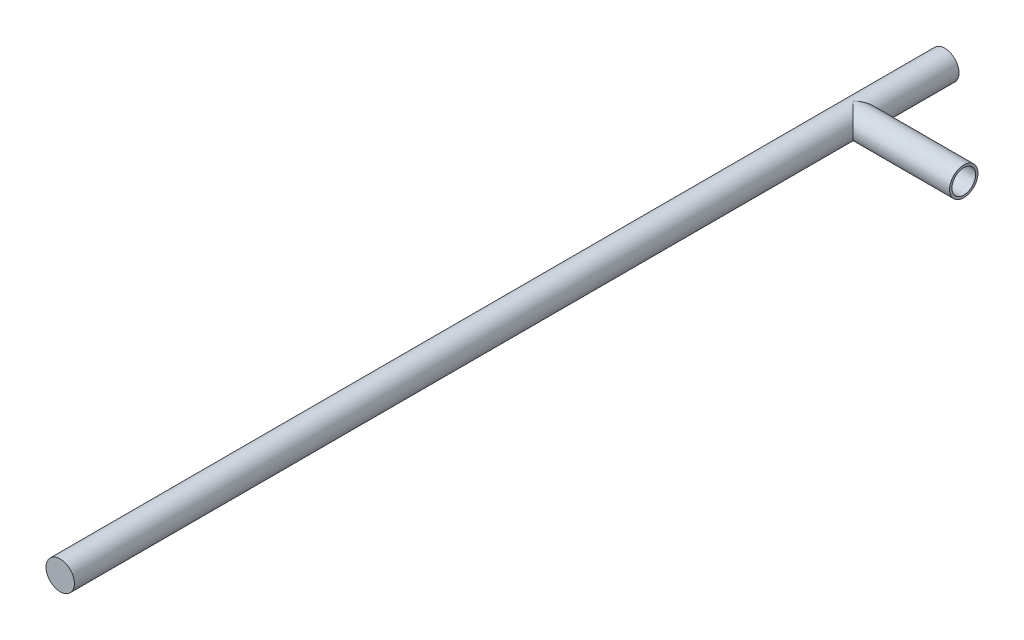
from build123d import *

# Parameters (mm, degrees)
CROQUIS1_R                 = 9
SALIENTE_EXTRUIR1_DEPTH    = 560
CORTAR_EXTRUIR1_REACH      = 562.145
CORTAR_EXTRUIR1_END_RADIUS = 9
CROQUIS3_R                 = 4.7625
CROQUIS4_R                 = 9
SALIENTE_EXTRUIR3_DEPTH    = 70
CROQUIS5_R                 = 7.5
CORTAR_EXTRUIR2_DEPTH      = 557
CROQUIS6_R                 = 7.5
CORTAR_EXTRUIR3_DEPTH      = 70


with BuildPart() as part:
    # Croquis1 → Saliente-Extruir1 (new body)
    with BuildSketch(Plane.XY):
        Circle(CROQUIS1_R)
    extrude(amount=SALIENTE_EXTRUIR1_DEPTH)

    # Cortar-Extruir1: up to this cylinder (the profile starts inside it)
    cortar_extruir1_end = Plane(origin=(0, 0, 286.576), z_dir=(0, 0, -1)) * Cylinder(CORTAR_EXTRUIR1_END_RADIUS, 1676.69, mode=Mode.PRIVATE)
    # Croquis3 → Cortar-Extruir1 (cut, up to the surface)
    with BuildSketch(Plane(origin=(0, 0, 0), x_dir=(0, 0, -1), z_dir=(1, 0, 0)), mode=Mode.PRIVATE) as cortar_extruir1_sk1:
        with Locations((-19.876, 0)):
            Circle(CROQUIS3_R)
    cortar_extruir1_tool1 = extrude(cortar_extruir1_sk1.sketch, amount=-CORTAR_EXTRUIR1_REACH, mode=Mode.PRIVATE) & cortar_extruir1_end
    add(cortar_extruir1_tool1.solids().sort_by_distance((0, 0, 19.876))[0], mode=Mode.SUBTRACT)
    # Croquis3 → Cortar-Extruir1 (cut, up to the surface)
    with BuildSketch(Plane(origin=(0, 0, 0), x_dir=(0, 0, -1), z_dir=(1, 0, 0)), mode=Mode.PRIVATE) as cortar_extruir1_sk2:
        with Locations((-45.276, 0)):
            Circle(CROQUIS3_R)
    cortar_extruir1_tool2 = extrude(cortar_extruir1_sk2.sketch, amount=-CORTAR_EXTRUIR1_REACH, mode=Mode.PRIVATE) & cortar_extruir1_end
    add(cortar_extruir1_tool2.solids().sort_by_distance((0, 0, 45.276))[0], mode=Mode.SUBTRACT)
    # Croquis3 → Cortar-Extruir1 (cut, up to the surface)
    with BuildSketch(Plane(origin=(0, 0, 0), x_dir=(0, 0, -1), z_dir=(1, 0, 0)), mode=Mode.PRIVATE) as cortar_extruir1_sk3:
        with Locations((-70.676, 0)):
            Circle(CROQUIS3_R)
    cortar_extruir1_tool3 = extrude(cortar_extruir1_sk3.sketch, amount=-CORTAR_EXTRUIR1_REACH, mode=Mode.PRIVATE) & cortar_extruir1_end
    add(cortar_extruir1_tool3.solids().sort_by_distance((0, 0, 70.676))[0], mode=Mode.SUBTRACT)
    # Croquis3 → Cortar-Extruir1 (cut, up to the surface)
    with BuildSketch(Plane(origin=(0, 0, 0), x_dir=(0, 0, -1), z_dir=(1, 0, 0)), mode=Mode.PRIVATE) as cortar_extruir1_sk4:
        with Locations((-96.076, 0)):
            Circle(CROQUIS3_R)
    cortar_extruir1_tool4 = extrude(cortar_extruir1_sk4.sketch, amount=-CORTAR_EXTRUIR1_REACH, mode=Mode.PRIVATE) & cortar_extruir1_end
    add(cortar_extruir1_tool4.solids().sort_by_distance((0, 0, 96.076))[0], mode=Mode.SUBTRACT)
    # Croquis3 → Cortar-Extruir1 (cut, up to the surface)
    with BuildSketch(Plane(origin=(0, 0, 0), x_dir=(0, 0, -1), z_dir=(1, 0, 0)), mode=Mode.PRIVATE) as cortar_extruir1_sk5:
        with Locations((-121.476, 0)):
            Circle(CROQUIS3_R)
    cortar_extruir1_tool5 = extrude(cortar_extruir1_sk5.sketch, amount=-CORTAR_EXTRUIR1_REACH, mode=Mode.PRIVATE) & cortar_extruir1_end
    add(cortar_extruir1_tool5.solids().sort_by_distance((0, 0, 121.476))[0], mode=Mode.SUBTRACT)
    # Croquis3 → Cortar-Extruir1 (cut, up to the surface)
    with BuildSketch(Plane(origin=(0, 0, 0), x_dir=(0, 0, -1), z_dir=(1, 0, 0)), mode=Mode.PRIVATE) as cortar_extruir1_sk6:
        with Locations((-146.876, 0)):
            Circle(CROQUIS3_R)
    cortar_extruir1_tool6 = extrude(cortar_extruir1_sk6.sketch, amount=-CORTAR_EXTRUIR1_REACH, mode=Mode.PRIVATE) & cortar_extruir1_end
    add(cortar_extruir1_tool6.solids().sort_by_distance((0, 0, 146.876))[0], mode=Mode.SUBTRACT)
    # Croquis3 → Cortar-Extruir1 (cut, up to the surface)
    with BuildSketch(Plane(origin=(0, 0, 0), x_dir=(0, 0, -1), z_dir=(1, 0, 0)), mode=Mode.PRIVATE) as cortar_extruir1_sk7:
        with Locations((-172.276, 0)):
            Circle(CROQUIS3_R)
    cortar_extruir1_tool7 = extrude(cortar_extruir1_sk7.sketch, amount=-CORTAR_EXTRUIR1_REACH, mode=Mode.PRIVATE) & cortar_extruir1_end
    add(cortar_extruir1_tool7.solids().sort_by_distance((0, 0, 172.276))[0], mode=Mode.SUBTRACT)
    # Croquis3 → Cortar-Extruir1 (cut, up to the surface)
    with BuildSketch(Plane(origin=(0, 0, 0), x_dir=(0, 0, -1), z_dir=(1, 0, 0)), mode=Mode.PRIVATE) as cortar_extruir1_sk8:
        with Locations((-197.676, 0)):
            Circle(CROQUIS3_R)
    cortar_extruir1_tool8 = extrude(cortar_extruir1_sk8.sketch, amount=-CORTAR_EXTRUIR1_REACH, mode=Mode.PRIVATE) & cortar_extruir1_end
    add(cortar_extruir1_tool8.solids().sort_by_distance((0, 0, 197.676))[0], mode=Mode.SUBTRACT)
    # Croquis3 → Cortar-Extruir1 (cut, up to the surface)
    with BuildSketch(Plane(origin=(0, 0, 0), x_dir=(0, 0, -1), z_dir=(1, 0, 0)), mode=Mode.PRIVATE) as cortar_extruir1_sk9:
        with Locations((-223.076, 0)):
            Circle(CROQUIS3_R)
    cortar_extruir1_tool9 = extrude(cortar_extruir1_sk9.sketch, amount=-CORTAR_EXTRUIR1_REACH, mode=Mode.PRIVATE) & cortar_extruir1_end
    add(cortar_extruir1_tool9.solids().sort_by_distance((0, 0, 223.076))[0], mode=Mode.SUBTRACT)
    # Croquis3 → Cortar-Extruir1 (cut, up to the surface)
    with BuildSketch(Plane(origin=(0, 0, 0), x_dir=(0, 0, -1), z_dir=(1, 0, 0)), mode=Mode.PRIVATE) as cortar_extruir1_sk10:
        with Locations((-248.476, 0)):
            Circle(CROQUIS3_R)
    cortar_extruir1_tool10 = extrude(cortar_extruir1_sk10.sketch, amount=-CORTAR_EXTRUIR1_REACH, mode=Mode.PRIVATE) & cortar_extruir1_end
    add(cortar_extruir1_tool10.solids().sort_by_distance((0, 0, 248.476))[0], mode=Mode.SUBTRACT)
    # Croquis3 → Cortar-Extruir1 (cut, up to the surface)
    with BuildSketch(Plane(origin=(0, 0, 0), x_dir=(0, 0, -1), z_dir=(1, 0, 0)), mode=Mode.PRIVATE) as cortar_extruir1_sk11:
        with Locations((-273.876, 0)):
            Circle(CROQUIS3_R)
    cortar_extruir1_tool11 = extrude(cortar_extruir1_sk11.sketch, amount=-CORTAR_EXTRUIR1_REACH, mode=Mode.PRIVATE) & cortar_extruir1_end
    add(cortar_extruir1_tool11.solids().sort_by_distance((0, 0, 273.876))[0], mode=Mode.SUBTRACT)
    # Croquis3 → Cortar-Extruir1 (cut, up to the surface)
    with BuildSketch(Plane(origin=(0, 0, 0), x_dir=(0, 0, -1), z_dir=(1, 0, 0)), mode=Mode.PRIVATE) as cortar_extruir1_sk12:
        with Locations((-299.276, 0)):
            Circle(CROQUIS3_R)
    cortar_extruir1_tool12 = extrude(cortar_extruir1_sk12.sketch, amount=-CORTAR_EXTRUIR1_REACH, mode=Mode.PRIVATE) & cortar_extruir1_end
    add(cortar_extruir1_tool12.solids().sort_by_distance((0, 0, 299.276))[0], mode=Mode.SUBTRACT)
    # Croquis3 → Cortar-Extruir1 (cut, up to the surface)
    with BuildSketch(Plane(origin=(0, 0, 0), x_dir=(0, 0, -1), z_dir=(1, 0, 0)), mode=Mode.PRIVATE) as cortar_extruir1_sk13:
        with Locations((-324.676, 0)):
            Circle(CROQUIS3_R)
    cortar_extruir1_tool13 = extrude(cortar_extruir1_sk13.sketch, amount=-CORTAR_EXTRUIR1_REACH, mode=Mode.PRIVATE) & cortar_extruir1_end
    add(cortar_extruir1_tool13.solids().sort_by_distance((0, 0, 324.676))[0], mode=Mode.SUBTRACT)
    # Croquis3 → Cortar-Extruir1 (cut, up to the surface)
    with BuildSketch(Plane(origin=(0, 0, 0), x_dir=(0, 0, -1), z_dir=(1, 0, 0)), mode=Mode.PRIVATE) as cortar_extruir1_sk14:
        with Locations((-350.076, 0)):
            Circle(CROQUIS3_R)
    cortar_extruir1_tool14 = extrude(cortar_extruir1_sk14.sketch, amount=-CORTAR_EXTRUIR1_REACH, mode=Mode.PRIVATE) & cortar_extruir1_end
    add(cortar_extruir1_tool14.solids().sort_by_distance((0, 0, 350.076))[0], mode=Mode.SUBTRACT)
    # Croquis3 → Cortar-Extruir1 (cut, up to the surface)
    with BuildSketch(Plane(origin=(0, 0, 0), x_dir=(0, 0, -1), z_dir=(1, 0, 0)), mode=Mode.PRIVATE) as cortar_extruir1_sk15:
        with Locations((-375.476, 0)):
            Circle(CROQUIS3_R)
    cortar_extruir1_tool15 = extrude(cortar_extruir1_sk15.sketch, amount=-CORTAR_EXTRUIR1_REACH, mode=Mode.PRIVATE) & cortar_extruir1_end
    add(cortar_extruir1_tool15.solids().sort_by_distance((0, 0, 375.476))[0], mode=Mode.SUBTRACT)
    # Croquis3 → Cortar-Extruir1 (cut, up to the surface)
    with BuildSketch(Plane(origin=(0, 0, 0), x_dir=(0, 0, -1), z_dir=(1, 0, 0)), mode=Mode.PRIVATE) as cortar_extruir1_sk16:
        with Locations((-400.876, 0)):
            Circle(CROQUIS3_R)
    cortar_extruir1_tool16 = extrude(cortar_extruir1_sk16.sketch, amount=-CORTAR_EXTRUIR1_REACH, mode=Mode.PRIVATE) & cortar_extruir1_end
    add(cortar_extruir1_tool16.solids().sort_by_distance((0, 0, 400.876))[0], mode=Mode.SUBTRACT)
    # Croquis3 → Cortar-Extruir1 (cut, up to the surface)
    with BuildSketch(Plane(origin=(0, 0, 0), x_dir=(0, 0, -1), z_dir=(1, 0, 0)), mode=Mode.PRIVATE) as cortar_extruir1_sk17:
        with Locations((-426.276, 0)):
            Circle(CROQUIS3_R)
    cortar_extruir1_tool17 = extrude(cortar_extruir1_sk17.sketch, amount=-CORTAR_EXTRUIR1_REACH, mode=Mode.PRIVATE) & cortar_extruir1_end
    add(cortar_extruir1_tool17.solids().sort_by_distance((0, 0, 426.276))[0], mode=Mode.SUBTRACT)
    # Croquis3 → Cortar-Extruir1 (cut, up to the surface)
    with BuildSketch(Plane(origin=(0, 0, 0), x_dir=(0, 0, -1), z_dir=(1, 0, 0)), mode=Mode.PRIVATE) as cortar_extruir1_sk18:
        with Locations((-451.676, 0)):
            Circle(CROQUIS3_R)
    cortar_extruir1_tool18 = extrude(cortar_extruir1_sk18.sketch, amount=-CORTAR_EXTRUIR1_REACH, mode=Mode.PRIVATE) & cortar_extruir1_end
    add(cortar_extruir1_tool18.solids().sort_by_distance((0, 0, 451.676))[0], mode=Mode.SUBTRACT)
    # Croquis3 → Cortar-Extruir1 (cut, up to the surface)
    with BuildSketch(Plane(origin=(0, 0, 0), x_dir=(0, 0, -1), z_dir=(1, 0, 0)), mode=Mode.PRIVATE) as cortar_extruir1_sk19:
        with Locations((-477.076, 0)):
            Circle(CROQUIS3_R)
    cortar_extruir1_tool19 = extrude(cortar_extruir1_sk19.sketch, amount=-CORTAR_EXTRUIR1_REACH, mode=Mode.PRIVATE) & cortar_extruir1_end
    add(cortar_extruir1_tool19.solids().sort_by_distance((0, 0, 477.076))[0], mode=Mode.SUBTRACT)
    # Croquis3 → Cortar-Extruir1 (cut, up to the surface)
    with BuildSketch(Plane(origin=(0, 0, 0), x_dir=(0, 0, -1), z_dir=(1, 0, 0)), mode=Mode.PRIVATE) as cortar_extruir1_sk20:
        with Locations((-502.476, 0)):
            Circle(CROQUIS3_R)
    cortar_extruir1_tool20 = extrude(cortar_extruir1_sk20.sketch, amount=-CORTAR_EXTRUIR1_REACH, mode=Mode.PRIVATE) & cortar_extruir1_end
    add(cortar_extruir1_tool20.solids().sort_by_distance((0, 0, 502.476))[0], mode=Mode.SUBTRACT)
    # Croquis3 → Cortar-Extruir1 (cut, up to the surface)
    with BuildSketch(Plane(origin=(0, 0, 0), x_dir=(0, 0, -1), z_dir=(1, 0, 0)), mode=Mode.PRIVATE) as cortar_extruir1_sk21:
        with Locations((-527.876, 0)):
            Circle(CROQUIS3_R)
    cortar_extruir1_tool21 = extrude(cortar_extruir1_sk21.sketch, amount=-CORTAR_EXTRUIR1_REACH, mode=Mode.PRIVATE) & cortar_extruir1_end
    add(cortar_extruir1_tool21.solids().sort_by_distance((0, 0, 527.876))[0], mode=Mode.SUBTRACT)
    # Croquis3 → Cortar-Extruir1 (cut, up to the surface)
    with BuildSketch(Plane(origin=(0, 0, 0), x_dir=(0, 0, -1), z_dir=(1, 0, 0)), mode=Mode.PRIVATE) as cortar_extruir1_sk22:
        with Locations((-553.276, 0)):
            Circle(CROQUIS3_R)
    cortar_extruir1_tool22 = extrude(cortar_extruir1_sk22.sketch, amount=-CORTAR_EXTRUIR1_REACH, mode=Mode.PRIVATE) & cortar_extruir1_end
    add(cortar_extruir1_tool22.solids().sort_by_distance((0, 0, 553.276))[0], mode=Mode.SUBTRACT)

    # Croquis4 → Saliente-Extruir3 (add)
    with BuildSketch(Plane(origin=(0, 0, 0), x_dir=(0, 0, -1), z_dir=(1, 0, 0))):
        with Locations((-58, 0)):
            Circle(CROQUIS4_R)
    extrude(amount=SALIENTE_EXTRUIR3_DEPTH)

    # Croquis5 → Cortar-Extruir2 (cut)
    with BuildSketch(Plane.XY.offset(1.7)):
        Circle(CROQUIS5_R)
    extrude(amount=CORTAR_EXTRUIR2_DEPTH, mode=Mode.SUBTRACT)

    # Croquis6 → Cortar-Extruir3 (cut)
    with BuildSketch(Plane(origin=(70, 0, 0), x_dir=(0, 0, -1), z_dir=(1, 0, 0))):
        with Locations((-58, 0)):
            Circle(CROQUIS6_R)
    extrude(amount=-CORTAR_EXTRUIR3_DEPTH, mode=Mode.SUBTRACT)


solid = part.part
